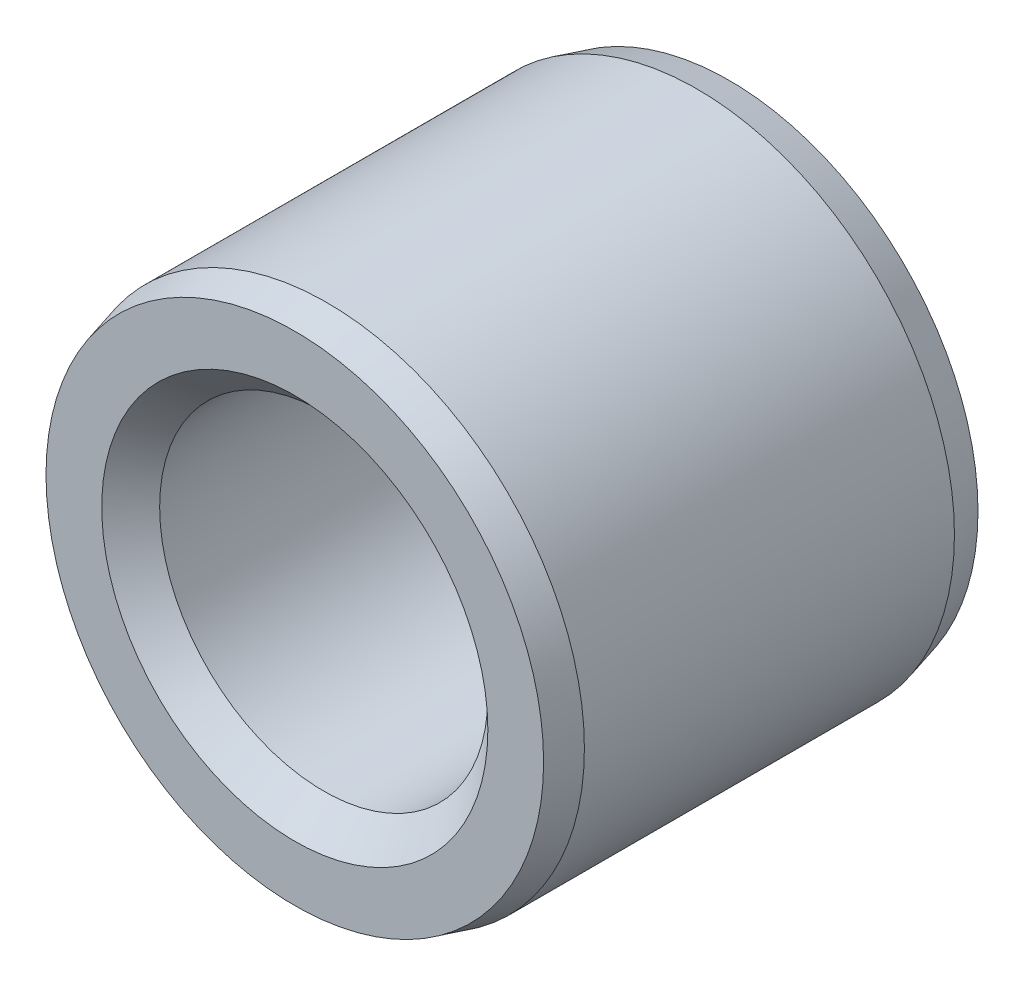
ISO-10303-21;
HEADER;
FILE_DESCRIPTION(('STEP AP214'),'2;1');
FILE_NAME('part.step','',(''),(''),'','','');
FILE_SCHEMA(('AUTOMOTIVE_DESIGN { 1 0 10303 214 1 1 1 1 }'));
ENDSEC;
DATA;
#1=APPLICATION_CONTEXT('core data for automotive mechanical design processes');
#2=APPLICATION_PROTOCOL_DEFINITION('international standard','automotive_design',2000,#1);
#3=PRODUCT_CONTEXT('',#1,'mechanical');
#4=PRODUCT('Part','Part','',(#3));
#5=PRODUCT_RELATED_PRODUCT_CATEGORY('part','',(#4));
#6=PRODUCT_DEFINITION_FORMATION('','',#4);
#7=PRODUCT_DEFINITION_CONTEXT('part definition',#1,'design');
#8=PRODUCT_DEFINITION('design','',#6,#7);
#9=PRODUCT_DEFINITION_SHAPE('','',#8);
#10=(LENGTH_UNIT() NAMED_UNIT(*) SI_UNIT(.MILLI.,.METRE.));
#11=(NAMED_UNIT(*) PLANE_ANGLE_UNIT() SI_UNIT($,.RADIAN.));
#12=(NAMED_UNIT(*) SI_UNIT($,.STERADIAN.) SOLID_ANGLE_UNIT());
#13=UNCERTAINTY_MEASURE_WITH_UNIT(LENGTH_MEASURE(1.E-05),#10,'distance_accuracy_value','');
#14=(GEOMETRIC_REPRESENTATION_CONTEXT(3) GLOBAL_UNCERTAINTY_ASSIGNED_CONTEXT((#13)) GLOBAL_UNIT_ASSIGNED_CONTEXT((#10,
#11,#12)) REPRESENTATION_CONTEXT('',''));
#15=CARTESIAN_POINT('',(0.,0.,0.));
#16=DIRECTION('',(0.,0.,1.));
#17=DIRECTION('',(1.,0.,0.));
#18=AXIS2_PLACEMENT_3D('',#15,#16,#17);
#19=CARTESIAN_POINT('',(0.,0.,-5.85));
#20=DIRECTION('',(0.,0.,-1.));
#21=DIRECTION('',(-1.,0.,0.));
#22=AXIS2_PLACEMENT_3D('',#19,#20,#21);
#23=CONICAL_SURFACE('',#22,5.1,0.78539816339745);
#24=CARTESIAN_POINT('',(0.,0.,-6.74));
#25=DIRECTION('',(0.,0.,1.));
#26=DIRECTION('',(1.,0.,0.));
#27=AXIS2_PLACEMENT_3D('',#24,#25,#26);
#28=CIRCLE('',#27,5.99);
#29=CARTESIAN_POINT('',(5.99,0.,-6.74));
#30=VERTEX_POINT('',#29);
#31=EDGE_CURVE('E69',#30,#30,#28,.T.);
#32=ORIENTED_EDGE('',*,*,#31,.F.);
#33=EDGE_LOOP('',(#32));
#34=FACE_BOUND('',#33,.T.);
#35=CARTESIAN_POINT('',(0.,0.,-5.85));
#36=DIRECTION('',(0.,0.,1.));
#37=DIRECTION('',(1.,0.,0.));
#38=AXIS2_PLACEMENT_3D('',#35,#36,#37);
#39=CIRCLE('',#38,5.1);
#40=CARTESIAN_POINT('',(5.1,0.,-5.85));
#41=VERTEX_POINT('',#40);
#42=EDGE_CURVE('E10',#41,#41,#39,.T.);
#43=ORIENTED_EDGE('',*,*,#42,.T.);
#44=EDGE_LOOP('',(#43));
#45=FACE_BOUND('',#44,.T.);
#46=ADVANCED_FACE('F32',(#34,#45),#23,.F.);
#47=CARTESIAN_POINT('',(0.,0.,6.75));
#48=DIRECTION('',(0.,0.,1.));
#49=DIRECTION('',(1.,0.,0.));
#50=AXIS2_PLACEMENT_3D('',#47,#48,#49);
#51=CYLINDRICAL_SURFACE('',#50,5.1);
#52=ORIENTED_EDGE('',*,*,#42,.F.);
#53=EDGE_LOOP('',(#52));
#54=FACE_BOUND('',#53,.T.);
#55=CARTESIAN_POINT('',(0.,0.,5.85));
#56=DIRECTION('',(0.,0.,1.));
#57=DIRECTION('',(1.,0.,0.));
#58=AXIS2_PLACEMENT_3D('',#55,#56,#57);
#59=CIRCLE('',#58,5.1);
#60=CARTESIAN_POINT('',(5.1,0.,5.85));
#61=VERTEX_POINT('',#60);
#62=EDGE_CURVE('E38',#61,#61,#59,.T.);
#63=ORIENTED_EDGE('',*,*,#62,.T.);
#64=EDGE_LOOP('',(#63));
#65=FACE_BOUND('',#64,.T.);
#66=ADVANCED_FACE('F76',(#54,#65),#51,.F.);
#67=CARTESIAN_POINT('',(0.,0.,6.75));
#68=DIRECTION('',(0.,0.,1.));
#69=DIRECTION('',(1.,0.,0.));
#70=AXIS2_PLACEMENT_3D('',#67,#68,#69);
#71=CONICAL_SURFACE('',#70,6.,0.78539816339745);
#72=ORIENTED_EDGE('',*,*,#62,.F.);
#73=EDGE_LOOP('',(#72));
#74=FACE_BOUND('',#73,.T.);
#75=CARTESIAN_POINT('',(0.,0.,6.75));
#76=DIRECTION('',(0.,0.,1.));
#77=DIRECTION('',(1.,0.,0.));
#78=AXIS2_PLACEMENT_3D('',#75,#76,#77);
#79=CIRCLE('',#78,6.);
#80=CARTESIAN_POINT('',(6.,0.,6.75));
#81=VERTEX_POINT('',#80);
#82=EDGE_CURVE('E42',#81,#81,#79,.T.);
#83=ORIENTED_EDGE('',*,*,#82,.T.);
#84=EDGE_LOOP('',(#83));
#85=FACE_BOUND('',#84,.T.);
#86=ADVANCED_FACE('F80',(#74,#85),#71,.F.);
#87=CARTESIAN_POINT('',(0.,6.,6.75));
#88=DIRECTION('',(0.,0.,-1.));
#89=DIRECTION('',(-1.,0.,0.));
#90=AXIS2_PLACEMENT_3D('',#87,#88,#89);
#91=PLANE('',#90);
#92=ORIENTED_EDGE('',*,*,#82,.F.);
#93=EDGE_LOOP('',(#92));
#94=FACE_BOUND('',#93,.T.);
#95=CARTESIAN_POINT('',(0.,0.,6.75));
#96=DIRECTION('',(0.,0.,1.));
#97=DIRECTION('',(1.,0.,0.));
#98=AXIS2_PLACEMENT_3D('',#95,#96,#97);
#99=CIRCLE('',#98,7.73205080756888);
#100=CARTESIAN_POINT('',(7.73205080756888,0.,6.75));
#101=VERTEX_POINT('',#100);
#102=EDGE_CURVE('E46',#101,#101,#99,.T.);
#103=ORIENTED_EDGE('',*,*,#102,.T.);
#104=EDGE_LOOP('',(#103));
#105=FACE_BOUND('',#104,.T.);
#106=ADVANCED_FACE('F85',(#94,#105),#91,.F.);
#107=CARTESIAN_POINT('',(0.,0.,5.75));
#108=DIRECTION('',(0.,0.,-1.));
#109=DIRECTION('',(-1.,0.,0.));
#110=AXIS2_PLACEMENT_3D('',#107,#108,#109);
#111=CONICAL_SURFACE('',#110,8.,0.26179938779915);
#112=ORIENTED_EDGE('',*,*,#102,.F.);
#113=EDGE_LOOP('',(#112));
#114=FACE_BOUND('',#113,.T.);
#115=CARTESIAN_POINT('',(0.,0.,5.75));
#116=DIRECTION('',(0.,0.,1.));
#117=DIRECTION('',(1.,0.,0.));
#118=AXIS2_PLACEMENT_3D('',#115,#116,#117);
#119=CIRCLE('',#118,8.);
#120=CARTESIAN_POINT('',(8.,0.,5.75));
#121=VERTEX_POINT('',#120);
#122=EDGE_CURVE('E51',#121,#121,#119,.T.);
#123=ORIENTED_EDGE('',*,*,#122,.T.);
#124=EDGE_LOOP('',(#123));
#125=FACE_BOUND('',#124,.T.);
#126=ADVANCED_FACE('F91',(#114,#125),#111,.T.);
#127=CARTESIAN_POINT('',(0.,0.,6.75));
#128=DIRECTION('',(0.,0.,1.));
#129=DIRECTION('',(1.,0.,0.));
#130=AXIS2_PLACEMENT_3D('',#127,#128,#129);
#131=CYLINDRICAL_SURFACE('',#130,8.);
#132=ORIENTED_EDGE('',*,*,#122,.F.);
#133=EDGE_LOOP('',(#132));
#134=FACE_BOUND('',#133,.T.);
#135=CARTESIAN_POINT('',(0.,0.,-5.75));
#136=DIRECTION('',(0.,0.,1.));
#137=DIRECTION('',(1.,0.,0.));
#138=AXIS2_PLACEMENT_3D('',#135,#136,#137);
#139=CIRCLE('',#138,8.);
#140=CARTESIAN_POINT('',(8.,0.,-5.75));
#141=VERTEX_POINT('',#140);
#142=EDGE_CURVE('E54',#141,#141,#139,.T.);
#143=ORIENTED_EDGE('',*,*,#142,.T.);
#144=EDGE_LOOP('',(#143));
#145=FACE_BOUND('',#144,.T.);
#146=ADVANCED_FACE('F95',(#134,#145),#131,.T.);
#147=CARTESIAN_POINT('',(0.,0.,-6.75));
#148=DIRECTION('',(0.,0.,1.));
#149=DIRECTION('',(1.,0.,0.));
#150=AXIS2_PLACEMENT_3D('',#147,#148,#149);
#151=CONICAL_SURFACE('',#150,7.73205080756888,0.26179938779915);
#152=ORIENTED_EDGE('',*,*,#142,.F.);
#153=EDGE_LOOP('',(#152));
#154=FACE_BOUND('',#153,.T.);
#155=CARTESIAN_POINT('',(0.,0.,-6.75));
#156=DIRECTION('',(0.,0.,1.));
#157=DIRECTION('',(1.,0.,0.));
#158=AXIS2_PLACEMENT_3D('',#155,#156,#157);
#159=CIRCLE('',#158,7.73205080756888);
#160=CARTESIAN_POINT('',(7.73205080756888,0.,-6.75));
#161=VERTEX_POINT('',#160);
#162=EDGE_CURVE('E57',#161,#161,#159,.T.);
#163=ORIENTED_EDGE('',*,*,#162,.T.);
#164=EDGE_LOOP('',(#163));
#165=FACE_BOUND('',#164,.T.);
#166=ADVANCED_FACE('F99',(#154,#165),#151,.T.);
#167=CARTESIAN_POINT('',(0.,6.,-6.75));
#168=DIRECTION('',(0.,0.,1.));
#169=DIRECTION('',(1.,0.,0.));
#170=AXIS2_PLACEMENT_3D('',#167,#168,#169);
#171=PLANE('',#170);
#172=ORIENTED_EDGE('',*,*,#162,.F.);
#173=EDGE_LOOP('',(#172));
#174=FACE_BOUND('',#173,.T.);
#175=CARTESIAN_POINT('',(0.,0.,-6.75));
#176=DIRECTION('',(0.,0.,1.));
#177=DIRECTION('',(1.,0.,0.));
#178=AXIS2_PLACEMENT_3D('',#175,#176,#177);
#179=CIRCLE('',#178,6.);
#180=CARTESIAN_POINT('',(6.,0.,-6.75));
#181=VERTEX_POINT('',#180);
#182=EDGE_CURVE('E60',#181,#181,#179,.T.);
#183=ORIENTED_EDGE('',*,*,#182,.T.);
#184=EDGE_LOOP('',(#183));
#185=FACE_BOUND('',#184,.T.);
#186=ADVANCED_FACE('F103',(#174,#185),#171,.F.);
#187=CARTESIAN_POINT('',(0.,0.,6.75));
#188=DIRECTION('',(0.,0.,1.));
#189=DIRECTION('',(1.,0.,0.));
#190=AXIS2_PLACEMENT_3D('',#187,#188,#189);
#191=CYLINDRICAL_SURFACE('',#190,6.);
#192=ORIENTED_EDGE('',*,*,#182,.F.);
#193=EDGE_LOOP('',(#192));
#194=FACE_BOUND('',#193,.T.);
#195=CARTESIAN_POINT('',(0.,0.,6.73585786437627));
#196=DIRECTION('',(0.,0.,1.));
#197=DIRECTION('',(1.,0.,0.));
#198=AXIS2_PLACEMENT_3D('',#195,#196,#197);
#199=CIRCLE('',#198,6.);
#200=CARTESIAN_POINT('',(6.,0.,6.73585786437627));
#201=VERTEX_POINT('',#200);
#202=EDGE_CURVE('E63',#201,#201,#199,.T.);
#203=ORIENTED_EDGE('',*,*,#202,.T.);
#204=EDGE_LOOP('',(#203));
#205=FACE_BOUND('',#204,.T.);
#206=ADVANCED_FACE('F107',(#194,#205),#191,.F.);
#207=CARTESIAN_POINT('',(0.,0.,6.72585786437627));
#208=DIRECTION('',(0.,0.,1.));
#209=DIRECTION('',(1.,0.,0.));
#210=AXIS2_PLACEMENT_3D('',#207,#208,#209);
#211=CONICAL_SURFACE('',#210,5.99,0.785398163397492);
#212=ORIENTED_EDGE('',*,*,#202,.F.);
#213=EDGE_LOOP('',(#212));
#214=FACE_BOUND('',#213,.T.);
#215=CARTESIAN_POINT('',(0.,0.,6.72585786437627));
#216=DIRECTION('',(0.,0.,1.));
#217=DIRECTION('',(1.,0.,0.));
#218=AXIS2_PLACEMENT_3D('',#215,#216,#217);
#219=CIRCLE('',#218,5.99);
#220=CARTESIAN_POINT('',(5.99,0.,6.72585786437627));
#221=VERTEX_POINT('',#220);
#222=EDGE_CURVE('E66',#221,#221,#219,.T.);
#223=ORIENTED_EDGE('',*,*,#222,.T.);
#224=EDGE_LOOP('',(#223));
#225=FACE_BOUND('',#224,.T.);
#226=ADVANCED_FACE('F111',(#214,#225),#211,.T.);
#227=CARTESIAN_POINT('',(0.,0.,6.75));
#228=DIRECTION('',(0.,0.,1.));
#229=DIRECTION('',(1.,0.,0.));
#230=AXIS2_PLACEMENT_3D('',#227,#228,#229);
#231=CYLINDRICAL_SURFACE('',#230,5.99);
#232=ORIENTED_EDGE('',*,*,#222,.F.);
#233=EDGE_LOOP('',(#232));
#234=FACE_BOUND('',#233,.T.);
#235=ORIENTED_EDGE('',*,*,#31,.T.);
#236=EDGE_LOOP('',(#235));
#237=FACE_BOUND('',#236,.T.);
#238=ADVANCED_FACE('F73',(#234,#237),#231,.T.);
#239=CLOSED_SHELL('',(#46,#66,#86,#106,#126,#146,#166,#186,#206,#226,#238));
#240=MANIFOLD_SOLID_BREP('B2',#239);
#241=ADVANCED_BREP_SHAPE_REPRESENTATION('',(#18,#240),#14);
#242=SHAPE_DEFINITION_REPRESENTATION(#9,#241);
ENDSEC;
END-ISO-10303-21;
